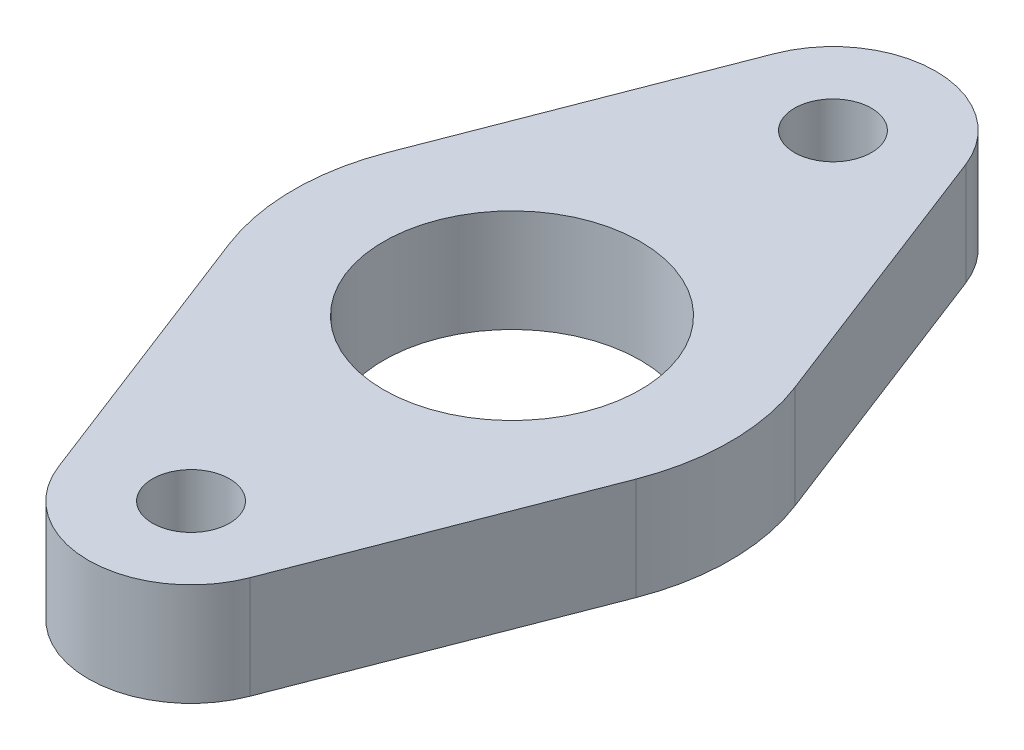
ISO-10303-21;
HEADER;
FILE_DESCRIPTION(('STEP AP214'),'2;1');
FILE_NAME('part.step','',(''),(''),'','','');
FILE_SCHEMA(('AUTOMOTIVE_DESIGN { 1 0 10303 214 1 1 1 1 }'));
ENDSEC;
DATA;
#1=APPLICATION_CONTEXT('core data for automotive mechanical design processes');
#2=APPLICATION_PROTOCOL_DEFINITION('international standard','automotive_design',2000,#1);
#3=PRODUCT_CONTEXT('',#1,'mechanical');
#4=PRODUCT('Part','Part','',(#3));
#5=PRODUCT_RELATED_PRODUCT_CATEGORY('part','',(#4));
#6=PRODUCT_DEFINITION_FORMATION('','',#4);
#7=PRODUCT_DEFINITION_CONTEXT('part definition',#1,'design');
#8=PRODUCT_DEFINITION('design','',#6,#7);
#9=PRODUCT_DEFINITION_SHAPE('','',#8);
#10=(LENGTH_UNIT() NAMED_UNIT(*) SI_UNIT(.MILLI.,.METRE.));
#11=(NAMED_UNIT(*) PLANE_ANGLE_UNIT() SI_UNIT($,.RADIAN.));
#12=(NAMED_UNIT(*) SI_UNIT($,.STERADIAN.) SOLID_ANGLE_UNIT());
#13=UNCERTAINTY_MEASURE_WITH_UNIT(LENGTH_MEASURE(1.E-05),#10,'distance_accuracy_value','');
#14=(GEOMETRIC_REPRESENTATION_CONTEXT(3) GLOBAL_UNCERTAINTY_ASSIGNED_CONTEXT((#13)) GLOBAL_UNIT_ASSIGNED_CONTEXT((#10,
#11,#12)) REPRESENTATION_CONTEXT('',''));
#15=CARTESIAN_POINT('',(0.,0.,0.));
#16=DIRECTION('',(0.,0.,1.));
#17=DIRECTION('',(1.,0.,0.));
#18=AXIS2_PLACEMENT_3D('',#15,#16,#17);
#19=CARTESIAN_POINT('',(0.,-2.,0.));
#20=DIRECTION('',(0.,1.,0.));
#21=DIRECTION('',(0.,0.,1.));
#22=AXIS2_PLACEMENT_3D('',#19,#20,#21);
#23=PLANE('',#22);
#24=CARTESIAN_POINT('',(0.,-2.,0.));
#25=DIRECTION('',(0.,1.,0.));
#26=DIRECTION('',(0.,0.,1.));
#27=AXIS2_PLACEMENT_3D('',#24,#25,#26);
#28=CIRCLE('',#27,5.);
#29=CARTESIAN_POINT('',(0.,-2.,5.));
#30=VERTEX_POINT('',#29);
#31=EDGE_CURVE('E171',#30,#30,#28,.T.);
#32=ORIENTED_EDGE('',*,*,#31,.T.);
#33=EDGE_LOOP('',(#32));
#34=FACE_BOUND('',#33,.T.);
#35=CARTESIAN_POINT('',(0.,-2.,12.5));
#36=DIRECTION('',(0.,1.,0.));
#37=DIRECTION('',(0.,0.,1.));
#38=AXIS2_PLACEMENT_3D('',#35,#36,#37);
#39=CIRCLE('',#38,1.5);
#40=CARTESIAN_POINT('',(0.,-2.,14.));
#41=VERTEX_POINT('',#40);
#42=EDGE_CURVE('E175',#41,#41,#39,.T.);
#43=ORIENTED_EDGE('',*,*,#42,.T.);
#44=EDGE_LOOP('',(#43));
#45=FACE_BOUND('',#44,.T.);
#46=CARTESIAN_POINT('',(0.,-2.,-12.5));
#47=DIRECTION('',(0.,1.,0.));
#48=DIRECTION('',(0.,0.,1.));
#49=AXIS2_PLACEMENT_3D('',#46,#47,#48);
#50=CIRCLE('',#49,1.5);
#51=CARTESIAN_POINT('',(0.,-2.,-11.));
#52=VERTEX_POINT('',#51);
#53=EDGE_CURVE('E179',#52,#52,#50,.T.);
#54=ORIENTED_EDGE('',*,*,#53,.T.);
#55=EDGE_LOOP('',(#54));
#56=FACE_BOUND('',#55,.T.);
#57=CARTESIAN_POINT('',(-0.1,-2.,0.));
#58=DIRECTION('',(0.,1.,0.));
#59=DIRECTION('',(0.,0.,1.));
#60=AXIS2_PLACEMENT_3D('',#57,#58,#59);
#61=CIRCLE('',#60,8.6);
#62=CARTESIAN_POINT('',(7.92160277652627,-2.,3.10062717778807));
#63=VERTEX_POINT('',#62);
#64=CARTESIAN_POINT('',(7.92160277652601,-2.,-3.10062717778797));
#65=VERTEX_POINT('',#64);
#66=EDGE_CURVE('E187',#63,#65,#61,.T.);
#67=ORIENTED_EDGE('',*,*,#66,.F.);
#68=DIRECTION('',(0.360538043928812,0.,-0.93274450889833));
#69=VECTOR('',#68,1.);
#70=CARTESIAN_POINT('',(3.730978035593,-2.,13.94215217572));
#71=LINE('',#70,#69);
#72=CARTESIAN_POINT('',(3.73097803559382,-2.,13.9421521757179));
#73=VERTEX_POINT('',#72);
#74=EDGE_CURVE('E141',#73,#63,#71,.T.);
#75=ORIENTED_EDGE('',*,*,#74,.F.);
#76=CARTESIAN_POINT('',(0.,-2.,12.5));
#77=DIRECTION('',(0.,1.,0.));
#78=DIRECTION('',(0.,0.,1.));
#79=AXIS2_PLACEMENT_3D('',#76,#77,#78);
#80=CIRCLE('',#79,4.);
#81=CARTESIAN_POINT('',(-3.73097803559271,-2.,13.9421521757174));
#82=VERTEX_POINT('',#81);
#83=EDGE_CURVE('E114',#82,#73,#80,.T.);
#84=ORIENTED_EDGE('',*,*,#83,.F.);
#85=DIRECTION('',(0.360538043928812,0.,0.93274450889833));
#86=VECTOR('',#85,1.);
#87=CARTESIAN_POINT('',(-7.921602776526,-2.,3.100627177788));
#88=LINE('',#87,#86);
#89=CARTESIAN_POINT('',(-7.92160277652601,-2.,3.10062717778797));
#90=VERTEX_POINT('',#89);
#91=EDGE_CURVE('E111',#90,#82,#88,.T.);
#92=ORIENTED_EDGE('',*,*,#91,.F.);
#93=CARTESIAN_POINT('',(0.1,-2.,0.));
#94=DIRECTION('',(0.,1.,0.));
#95=DIRECTION('',(0.,0.,1.));
#96=AXIS2_PLACEMENT_3D('',#93,#94,#95);
#97=CIRCLE('',#96,8.6);
#98=CARTESIAN_POINT('',(-7.92160277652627,-2.,-3.10062717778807));
#99=VERTEX_POINT('',#98);
#100=EDGE_CURVE('E20',#99,#90,#97,.T.);
#101=ORIENTED_EDGE('',*,*,#100,.F.);
#102=DIRECTION('',(-0.360538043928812,0.,0.93274450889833));
#103=VECTOR('',#102,1.);
#104=CARTESIAN_POINT('',(-3.730978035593,-2.,-13.94215217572));
#105=LINE('',#104,#103);
#106=CARTESIAN_POINT('',(-3.73097803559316,-2.,-13.9421521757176));
#107=VERTEX_POINT('',#106);
#108=EDGE_CURVE('E95',#107,#99,#105,.T.);
#109=ORIENTED_EDGE('',*,*,#108,.F.);
#110=CARTESIAN_POINT('',(0.,-2.,-12.5));
#111=DIRECTION('',(0.,1.,0.));
#112=DIRECTION('',(0.,0.,1.));
#113=AXIS2_PLACEMENT_3D('',#110,#111,#112);
#114=CIRCLE('',#113,4.);
#115=CARTESIAN_POINT('',(3.73097803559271,-2.,-13.9421521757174));
#116=VERTEX_POINT('',#115);
#117=EDGE_CURVE('E183',#116,#107,#114,.T.);
#118=ORIENTED_EDGE('',*,*,#117,.F.);
#119=DIRECTION('',(-0.360538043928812,0.,-0.93274450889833));
#120=VECTOR('',#119,1.);
#121=CARTESIAN_POINT('',(7.921602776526,-2.,-3.100627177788));
#122=LINE('',#121,#120);
#123=EDGE_CURVE('E134',#65,#116,#122,.T.);
#124=ORIENTED_EDGE('',*,*,#123,.F.);
#125=EDGE_LOOP('',(#67,#75,#84,#92,#101,#109,#118,#124));
#126=FACE_BOUND('',#125,.T.);
#127=ADVANCED_FACE('F17',(#34,#45,#56,#126),#23,.F.);
#128=CARTESIAN_POINT('',(-3.730978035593,-2.,-13.94215217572));
#129=DIRECTION('',(-0.93274450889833,0.,-0.360538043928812));
#130=DIRECTION('',(-0.360538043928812,0.,0.93274450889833));
#131=AXIS2_PLACEMENT_3D('',#128,#129,#130);
#132=PLANE('',#131);
#133=DIRECTION('',(0.,1.,0.));
#134=VECTOR('',#133,1.);
#135=CARTESIAN_POINT('',(-3.73097803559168,-2.,-13.9421521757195));
#136=LINE('',#135,#134);
#137=CARTESIAN_POINT('',(-3.73097803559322,2.,-13.9421521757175));
#138=VERTEX_POINT('',#137);
#139=EDGE_CURVE('E137',#107,#138,#136,.T.);
#140=ORIENTED_EDGE('',*,*,#139,.F.);
#141=ORIENTED_EDGE('',*,*,#108,.T.);
#142=DIRECTION('',(0.,1.,0.));
#143=VECTOR('',#142,1.);
#144=CARTESIAN_POINT('',(-7.92160277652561,-2.,-3.10062717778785));
#145=LINE('',#144,#143);
#146=CARTESIAN_POINT('',(-7.92160277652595,2.,-3.10062717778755));
#147=VERTEX_POINT('',#146);
#148=EDGE_CURVE('E107',#147,#99,#145,.F.);
#149=ORIENTED_EDGE('',*,*,#148,.F.);
#150=DIRECTION('',(-0.360538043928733,0.,0.93274450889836));
#151=VECTOR('',#150,1.);
#152=CARTESIAN_POINT('',(-3.730978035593,2.,-13.94215217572));
#153=LINE('',#152,#151);
#154=EDGE_CURVE('E170',#138,#147,#153,.T.);
#155=ORIENTED_EDGE('',*,*,#154,.F.);
#156=EDGE_LOOP('',(#140,#141,#149,#155));
#157=FACE_BOUND('',#156,.T.);
#158=ADVANCED_FACE('F231',(#157),#132,.T.);
#159=CARTESIAN_POINT('',(0.1,-2.,0.));
#160=DIRECTION('',(0.,1.,0.));
#161=DIRECTION('',(0.,0.,1.));
#162=AXIS2_PLACEMENT_3D('',#159,#160,#161);
#163=CYLINDRICAL_SURFACE('',#162,8.6);
#164=ORIENTED_EDGE('',*,*,#148,.T.);
#165=ORIENTED_EDGE('',*,*,#100,.T.);
#166=DIRECTION('',(0.,1.,0.));
#167=VECTOR('',#166,1.);
#168=CARTESIAN_POINT('',(-7.921602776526,-2.,3.100627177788));
#169=LINE('',#168,#167);
#170=CARTESIAN_POINT('',(-7.92160277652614,2.,3.10062717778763));
#171=VERTEX_POINT('',#170);
#172=EDGE_CURVE('E105',#171,#90,#169,.F.);
#173=ORIENTED_EDGE('',*,*,#172,.F.);
#174=CARTESIAN_POINT('',(0.1,2.,0.));
#175=DIRECTION('',(0.,1.,0.));
#176=DIRECTION('',(0.,0.,1.));
#177=AXIS2_PLACEMENT_3D('',#174,#175,#176);
#178=CIRCLE('',#177,8.6);
#179=EDGE_CURVE('E167',#147,#171,#178,.T.);
#180=ORIENTED_EDGE('',*,*,#179,.F.);
#181=EDGE_LOOP('',(#164,#165,#173,#180));
#182=FACE_BOUND('',#181,.T.);
#183=ADVANCED_FACE('F102',(#182),#163,.T.);
#184=CARTESIAN_POINT('',(-7.921602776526,-2.,3.100627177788));
#185=DIRECTION('',(-0.93274450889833,0.,0.360538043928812));
#186=DIRECTION('',(0.360538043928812,0.,0.93274450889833));
#187=AXIS2_PLACEMENT_3D('',#184,#185,#186);
#188=PLANE('',#187);
#189=ORIENTED_EDGE('',*,*,#172,.T.);
#190=ORIENTED_EDGE('',*,*,#91,.T.);
#191=DIRECTION('',(0.,1.,0.));
#192=VECTOR('',#191,1.);
#193=CARTESIAN_POINT('',(-3.73097803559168,-2.,13.9421521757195));
#194=LINE('',#193,#192);
#195=CARTESIAN_POINT('',(-3.73097803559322,2.,13.9421521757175));
#196=VERTEX_POINT('',#195);
#197=EDGE_CURVE('E118',#196,#82,#194,.F.);
#198=ORIENTED_EDGE('',*,*,#197,.F.);
#199=DIRECTION('',(0.360538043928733,0.,0.93274450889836));
#200=VECTOR('',#199,1.);
#201=CARTESIAN_POINT('',(-7.921602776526,2.,3.100627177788));
#202=LINE('',#201,#200);
#203=EDGE_CURVE('E122',#171,#196,#202,.T.);
#204=ORIENTED_EDGE('',*,*,#203,.F.);
#205=EDGE_LOOP('',(#189,#190,#198,#204));
#206=FACE_BOUND('',#205,.T.);
#207=ADVANCED_FACE('F120',(#206),#188,.T.);
#208=CARTESIAN_POINT('',(0.,-2.,12.5));
#209=DIRECTION('',(0.,1.,0.));
#210=DIRECTION('',(0.,0.,1.));
#211=AXIS2_PLACEMENT_3D('',#208,#209,#210);
#212=CYLINDRICAL_SURFACE('',#211,4.);
#213=ORIENTED_EDGE('',*,*,#197,.T.);
#214=ORIENTED_EDGE('',*,*,#83,.T.);
#215=DIRECTION('',(0.,1.,0.));
#216=VECTOR('',#215,1.);
#217=CARTESIAN_POINT('',(3.730978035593,-2.,13.94215217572));
#218=LINE('',#217,#216);
#219=CARTESIAN_POINT('',(3.73097803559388,2.,13.9421521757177));
#220=VERTEX_POINT('',#219);
#221=EDGE_CURVE('E144',#220,#73,#218,.F.);
#222=ORIENTED_EDGE('',*,*,#221,.F.);
#223=CARTESIAN_POINT('',(0.,2.,12.5));
#224=DIRECTION('',(0.,1.,0.));
#225=DIRECTION('',(0.,0.,1.));
#226=AXIS2_PLACEMENT_3D('',#223,#224,#225);
#227=CIRCLE('',#226,4.);
#228=EDGE_CURVE('E163',#196,#220,#227,.T.);
#229=ORIENTED_EDGE('',*,*,#228,.F.);
#230=EDGE_LOOP('',(#213,#214,#222,#229));
#231=FACE_BOUND('',#230,.T.);
#232=ADVANCED_FACE('F195',(#231),#212,.T.);
#233=CARTESIAN_POINT('',(3.730978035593,-2.,13.94215217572));
#234=DIRECTION('',(0.93274450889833,0.,0.360538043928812));
#235=DIRECTION('',(0.360538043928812,0.,-0.93274450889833));
#236=AXIS2_PLACEMENT_3D('',#233,#234,#235);
#237=PLANE('',#236);
#238=ORIENTED_EDGE('',*,*,#221,.T.);
#239=ORIENTED_EDGE('',*,*,#74,.T.);
#240=DIRECTION('',(0.,1.,0.));
#241=VECTOR('',#240,1.);
#242=CARTESIAN_POINT('',(7.92160277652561,-2.,3.10062717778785));
#243=LINE('',#242,#241);
#244=CARTESIAN_POINT('',(7.92160277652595,2.,3.10062717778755));
#245=VERTEX_POINT('',#244);
#246=EDGE_CURVE('E143',#245,#63,#243,.F.);
#247=ORIENTED_EDGE('',*,*,#246,.F.);
#248=DIRECTION('',(0.360538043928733,0.,-0.93274450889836));
#249=VECTOR('',#248,1.);
#250=CARTESIAN_POINT('',(3.730978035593,2.,13.94215217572));
#251=LINE('',#250,#249);
#252=EDGE_CURVE('E162',#220,#245,#251,.T.);
#253=ORIENTED_EDGE('',*,*,#252,.F.);
#254=EDGE_LOOP('',(#238,#239,#247,#253));
#255=FACE_BOUND('',#254,.T.);
#256=ADVANCED_FACE('F223',(#255),#237,.T.);
#257=CARTESIAN_POINT('',(-0.1,-2.,0.));
#258=DIRECTION('',(0.,1.,0.));
#259=DIRECTION('',(0.,0.,1.));
#260=AXIS2_PLACEMENT_3D('',#257,#258,#259);
#261=CYLINDRICAL_SURFACE('',#260,8.6);
#262=ORIENTED_EDGE('',*,*,#246,.T.);
#263=ORIENTED_EDGE('',*,*,#66,.T.);
#264=DIRECTION('',(0.,1.,0.));
#265=VECTOR('',#264,1.);
#266=CARTESIAN_POINT('',(7.921602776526,-2.,-3.100627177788));
#267=LINE('',#266,#265);
#268=CARTESIAN_POINT('',(7.92160277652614,2.,-3.10062717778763));
#269=VERTEX_POINT('',#268);
#270=EDGE_CURVE('E138',#269,#65,#267,.F.);
#271=ORIENTED_EDGE('',*,*,#270,.F.);
#272=CARTESIAN_POINT('',(-0.1,2.,0.));
#273=DIRECTION('',(0.,1.,0.));
#274=DIRECTION('',(0.,0.,1.));
#275=AXIS2_PLACEMENT_3D('',#272,#273,#274);
#276=CIRCLE('',#275,8.6);
#277=EDGE_CURVE('E158',#245,#269,#276,.T.);
#278=ORIENTED_EDGE('',*,*,#277,.F.);
#279=EDGE_LOOP('',(#262,#263,#271,#278));
#280=FACE_BOUND('',#279,.T.);
#281=ADVANCED_FACE('F220',(#280),#261,.T.);
#282=CARTESIAN_POINT('',(7.921602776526,-2.,-3.100627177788));
#283=DIRECTION('',(0.93274450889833,0.,-0.360538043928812));
#284=DIRECTION('',(-0.360538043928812,0.,-0.93274450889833));
#285=AXIS2_PLACEMENT_3D('',#282,#283,#284);
#286=PLANE('',#285);
#287=ORIENTED_EDGE('',*,*,#270,.T.);
#288=ORIENTED_EDGE('',*,*,#123,.T.);
#289=DIRECTION('',(0.,1.,0.));
#290=VECTOR('',#289,1.);
#291=CARTESIAN_POINT('',(3.73097803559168,-2.,-13.9421521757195));
#292=LINE('',#291,#290);
#293=CARTESIAN_POINT('',(3.73097803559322,2.,-13.9421521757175));
#294=VERTEX_POINT('',#293);
#295=EDGE_CURVE('E40',#294,#116,#292,.F.);
#296=ORIENTED_EDGE('',*,*,#295,.F.);
#297=DIRECTION('',(-0.360538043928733,0.,-0.93274450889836));
#298=VECTOR('',#297,1.);
#299=CARTESIAN_POINT('',(7.921602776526,2.,-3.100627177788));
#300=LINE('',#299,#298);
#301=EDGE_CURVE('E157',#269,#294,#300,.T.);
#302=ORIENTED_EDGE('',*,*,#301,.F.);
#303=EDGE_LOOP('',(#287,#288,#296,#302));
#304=FACE_BOUND('',#303,.T.);
#305=ADVANCED_FACE('F225',(#304),#286,.T.);
#306=CARTESIAN_POINT('',(0.,-2.,-12.5));
#307=DIRECTION('',(0.,1.,0.));
#308=DIRECTION('',(0.,0.,1.));
#309=AXIS2_PLACEMENT_3D('',#306,#307,#308);
#310=CYLINDRICAL_SURFACE('',#309,4.);
#311=ORIENTED_EDGE('',*,*,#295,.T.);
#312=ORIENTED_EDGE('',*,*,#117,.T.);
#313=ORIENTED_EDGE('',*,*,#139,.T.);
#314=CARTESIAN_POINT('',(0.,2.,-12.5));
#315=DIRECTION('',(0.,1.,0.));
#316=DIRECTION('',(0.,0.,1.));
#317=AXIS2_PLACEMENT_3D('',#314,#315,#316);
#318=CIRCLE('',#317,4.);
#319=EDGE_CURVE('E153',#294,#138,#318,.T.);
#320=ORIENTED_EDGE('',*,*,#319,.F.);
#321=EDGE_LOOP('',(#311,#312,#313,#320));
#322=FACE_BOUND('',#321,.T.);
#323=ADVANCED_FACE('F230',(#322),#310,.T.);
#324=CARTESIAN_POINT('',(0.,-2.,-12.5));
#325=DIRECTION('',(0.,1.,0.));
#326=DIRECTION('',(0.,0.,1.));
#327=AXIS2_PLACEMENT_3D('',#324,#325,#326);
#328=CYLINDRICAL_SURFACE('',#327,1.5);
#329=CARTESIAN_POINT('',(0.,2.,-12.5));
#330=DIRECTION('',(0.,1.,0.));
#331=DIRECTION('',(0.,0.,1.));
#332=AXIS2_PLACEMENT_3D('',#329,#330,#331);
#333=CIRCLE('',#332,1.5);
#334=CARTESIAN_POINT('',(0.,2.,-11.));
#335=VERTEX_POINT('',#334);
#336=EDGE_CURVE('E149',#335,#335,#333,.F.);
#337=ORIENTED_EDGE('',*,*,#336,.F.);
#338=EDGE_LOOP('',(#337));
#339=FACE_BOUND('',#338,.T.);
#340=ORIENTED_EDGE('',*,*,#53,.F.);
#341=EDGE_LOOP('',(#340));
#342=FACE_BOUND('',#341,.T.);
#343=ADVANCED_FACE('F252',(#339,#342),#328,.F.);
#344=CARTESIAN_POINT('',(0.,-2.,12.5));
#345=DIRECTION('',(0.,1.,0.));
#346=DIRECTION('',(0.,0.,1.));
#347=AXIS2_PLACEMENT_3D('',#344,#345,#346);
#348=CYLINDRICAL_SURFACE('',#347,1.5);
#349=CARTESIAN_POINT('',(0.,2.,12.5));
#350=DIRECTION('',(0.,1.,0.));
#351=DIRECTION('',(0.,0.,1.));
#352=AXIS2_PLACEMENT_3D('',#349,#350,#351);
#353=CIRCLE('',#352,1.5);
#354=CARTESIAN_POINT('',(0.,2.,14.));
#355=VERTEX_POINT('',#354);
#356=EDGE_CURVE('E27',#355,#355,#353,.F.);
#357=ORIENTED_EDGE('',*,*,#356,.F.);
#358=EDGE_LOOP('',(#357));
#359=FACE_BOUND('',#358,.T.);
#360=ORIENTED_EDGE('',*,*,#42,.F.);
#361=EDGE_LOOP('',(#360));
#362=FACE_BOUND('',#361,.T.);
#363=ADVANCED_FACE('F245',(#359,#362),#348,.F.);
#364=CARTESIAN_POINT('',(0.,-2.,0.));
#365=DIRECTION('',(0.,1.,0.));
#366=DIRECTION('',(0.,0.,1.));
#367=AXIS2_PLACEMENT_3D('',#364,#365,#366);
#368=CYLINDRICAL_SURFACE('',#367,5.);
#369=CARTESIAN_POINT('',(0.,2.,0.));
#370=DIRECTION('',(0.,1.,0.));
#371=DIRECTION('',(0.,0.,1.));
#372=AXIS2_PLACEMENT_3D('',#369,#370,#371);
#373=CIRCLE('',#372,5.);
#374=CARTESIAN_POINT('',(0.,2.,5.));
#375=VERTEX_POINT('',#374);
#376=EDGE_CURVE('E11',#375,#375,#373,.F.);
#377=ORIENTED_EDGE('',*,*,#376,.F.);
#378=EDGE_LOOP('',(#377));
#379=FACE_BOUND('',#378,.T.);
#380=ORIENTED_EDGE('',*,*,#31,.F.);
#381=EDGE_LOOP('',(#380));
#382=FACE_BOUND('',#381,.T.);
#383=ADVANCED_FACE('F241',(#379,#382),#368,.F.);
#384=CARTESIAN_POINT('',(0.,2.,0.));
#385=DIRECTION('',(0.,1.,0.));
#386=DIRECTION('',(0.,0.,1.));
#387=AXIS2_PLACEMENT_3D('',#384,#385,#386);
#388=PLANE('',#387);
#389=ORIENTED_EDGE('',*,*,#376,.T.);
#390=EDGE_LOOP('',(#389));
#391=FACE_BOUND('',#390,.T.);
#392=ORIENTED_EDGE('',*,*,#356,.T.);
#393=EDGE_LOOP('',(#392));
#394=FACE_BOUND('',#393,.T.);
#395=ORIENTED_EDGE('',*,*,#336,.T.);
#396=EDGE_LOOP('',(#395));
#397=FACE_BOUND('',#396,.T.);
#398=ORIENTED_EDGE('',*,*,#301,.T.);
#399=ORIENTED_EDGE('',*,*,#319,.T.);
#400=ORIENTED_EDGE('',*,*,#154,.T.);
#401=ORIENTED_EDGE('',*,*,#179,.T.);
#402=ORIENTED_EDGE('',*,*,#203,.T.);
#403=ORIENTED_EDGE('',*,*,#228,.T.);
#404=ORIENTED_EDGE('',*,*,#252,.T.);
#405=ORIENTED_EDGE('',*,*,#277,.T.);
#406=EDGE_LOOP('',(#398,#399,#400,#401,#402,#403,#404,#405));
#407=FACE_BOUND('',#406,.T.);
#408=ADVANCED_FACE('F200',(#391,#394,#397,#407),#388,.T.);
#409=CLOSED_SHELL('',(#127,#158,#183,#207,#232,#256,#281,#305,#323,#343,#363,#383,#408));
#410=MANIFOLD_SOLID_BREP('B1',#409);
#411=ADVANCED_BREP_SHAPE_REPRESENTATION('',(#18,#410),#14);
#412=SHAPE_DEFINITION_REPRESENTATION(#9,#411);
ENDSEC;
END-ISO-10303-21;
